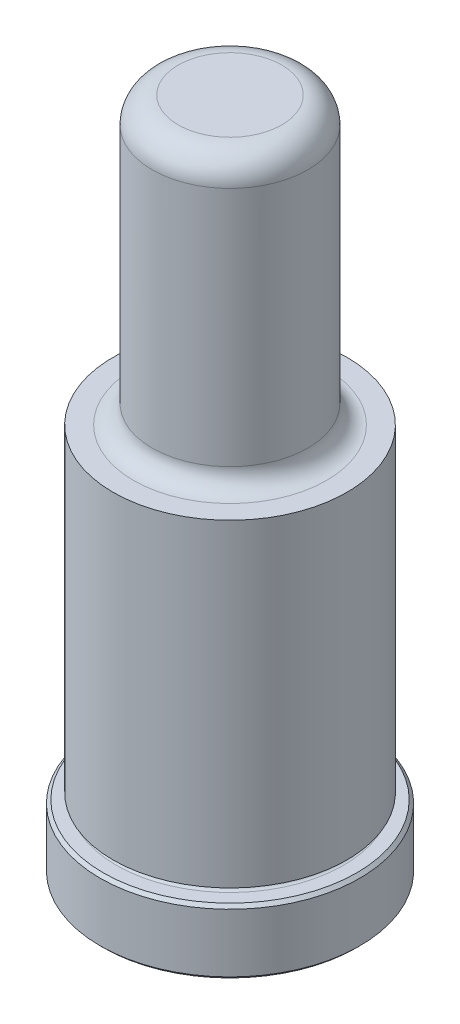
from build123d import *

# Parameters (mm, degrees)
CHAMFER1_SIZE = 0.381
FILLET1_R     = 3.175


with BuildPart() as part:
    # Sketch1 → Revolve1 (revolve)
    with BuildSketch(Plane(origin=(0, 0, 0), x_dir=(0, 0, -1), z_dir=(1, 0, 0)), mode=Mode.PRIVATE) as revolve1_sk:
        with BuildLine():
            Line((0, 0), (15.875, 0))
            Line((15.875, 0), (15.875, 7.9248))
            Line((15.875, 7.9248), (13.8938, 7.9248))
            ThreePointArc((13.8938, 7.9248), (13.5128, 8.3058), (13.8938, 8.6868))
            Line((13.8938, 8.6868), (14.3002, 8.6868))
            Line((14.3002, 8.6868), (14.3002, 47.625))
            Line((14.3002, 47.625), (11.7983, 47.625))
            ThreePointArc((11.7983, 47.625), (10.181853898, 48.294553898), (9.5123, 49.911))
            Line((9.5123, 49.911), (9.5123, 82.55))
            Line((9.5123, 82.55), (0, 82.55))
            Line((0, 82.55), (0, 0))
        make_face()
    revolve(revolve1_sk.sketch.rotate(Axis((0, 0, 0), (0, -1, 0)), 180), axis=Axis((0, 0, 0), (0, -1, 0)))

    # Chamfer1
    chamfer1_edges = [part.edges().sort_by_distance(p)[0] for p in [
        (0, 7.9248, -15.875),
        (0, 0, -15.875),
    ]]
    chamfer(chamfer1_edges, length=CHAMFER1_SIZE)

    # Fillet1
    fillet1_edges = [part.edges().sort_by_distance(p)[0] for p in [
        (0, 82.55, -9.5123),
    ]]
    fillet(fillet1_edges, radius=FILLET1_R)


solid = part.part
